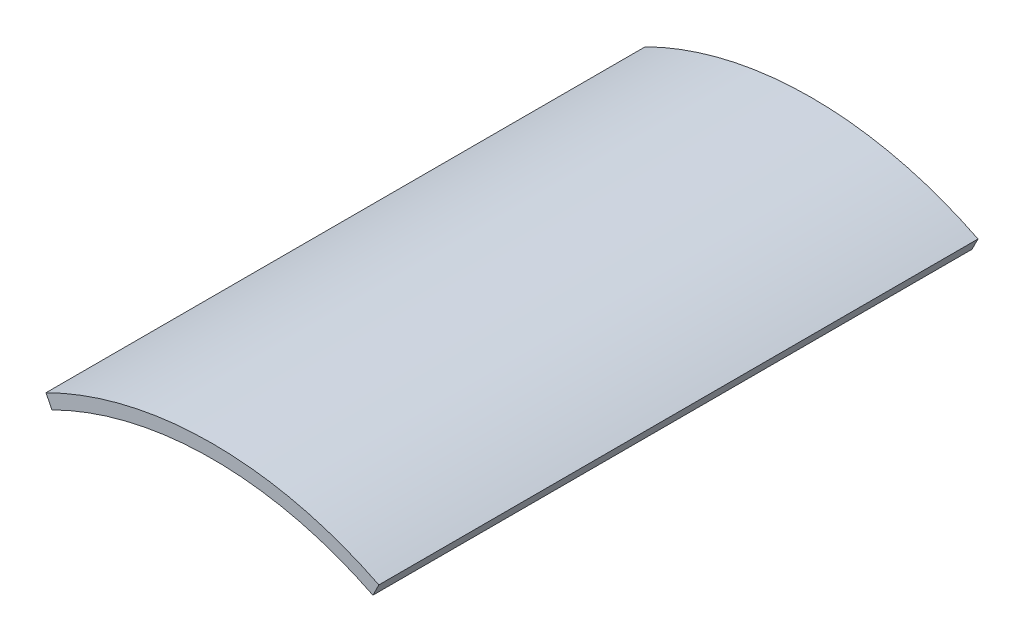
ISO-10303-21;
HEADER;
FILE_DESCRIPTION(('STEP AP214'),'2;1');
FILE_NAME('part.step','',(''),(''),'','','');
FILE_SCHEMA(('AUTOMOTIVE_DESIGN { 1 0 10303 214 1 1 1 1 }'));
ENDSEC;
DATA;
#1=APPLICATION_CONTEXT('core data for automotive mechanical design processes');
#2=APPLICATION_PROTOCOL_DEFINITION('international standard','automotive_design',2000,#1);
#3=PRODUCT_CONTEXT('',#1,'mechanical');
#4=PRODUCT('Part','Part','',(#3));
#5=PRODUCT_RELATED_PRODUCT_CATEGORY('part','',(#4));
#6=PRODUCT_DEFINITION_FORMATION('','',#4);
#7=PRODUCT_DEFINITION_CONTEXT('part definition',#1,'design');
#8=PRODUCT_DEFINITION('design','',#6,#7);
#9=PRODUCT_DEFINITION_SHAPE('','',#8);
#10=(LENGTH_UNIT() NAMED_UNIT(*) SI_UNIT(.MILLI.,.METRE.));
#11=(NAMED_UNIT(*) PLANE_ANGLE_UNIT() SI_UNIT($,.RADIAN.));
#12=(NAMED_UNIT(*) SI_UNIT($,.STERADIAN.) SOLID_ANGLE_UNIT());
#13=UNCERTAINTY_MEASURE_WITH_UNIT(LENGTH_MEASURE(1.E-05),#10,'distance_accuracy_value','');
#14=(GEOMETRIC_REPRESENTATION_CONTEXT(3) GLOBAL_UNCERTAINTY_ASSIGNED_CONTEXT((#13)) GLOBAL_UNIT_ASSIGNED_CONTEXT((#10,
#11,#12)) REPRESENTATION_CONTEXT('',''));
#15=CARTESIAN_POINT('',(0.,0.,0.));
#16=DIRECTION('',(0.,0.,1.));
#17=DIRECTION('',(1.,0.,0.));
#18=AXIS2_PLACEMENT_3D('',#15,#16,#17);
#19=CARTESIAN_POINT('',(0.,-28.575,45.72));
#20=DIRECTION('',(0.,0.,-1.));
#21=DIRECTION('',(-1.,0.,0.));
#22=AXIS2_PLACEMENT_3D('',#19,#20,#21);
#23=CYLINDRICAL_SURFACE('',#22,27.434913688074);
#24=CARTESIAN_POINT('',(0.,-28.575,0.));
#25=DIRECTION('',(0.,0.,1.));
#26=DIRECTION('',(1.,0.,0.));
#27=AXIS2_PLACEMENT_3D('',#24,#25,#26);
#28=CIRCLE('',#27,27.434913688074);
#29=CARTESIAN_POINT('',(-12.2464750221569,-4.02508475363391,0.));
#30=VERTEX_POINT('',#29);
#31=CARTESIAN_POINT('',(12.2464750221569,-4.02508475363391,0.));
#32=VERTEX_POINT('',#31);
#33=EDGE_CURVE('E82',#30,#32,#28,.F.);
#34=ORIENTED_EDGE('',*,*,#33,.T.);
#35=DIRECTION('',(0.,0.,-1.));
#36=VECTOR('',#35,1.);
#37=CARTESIAN_POINT('',(12.2464750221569,-4.02508475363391,45.72));
#38=LINE('',#37,#36);
#39=CARTESIAN_POINT('',(12.2464750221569,-4.02508475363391,45.72));
#40=VERTEX_POINT('',#39);
#41=EDGE_CURVE('E11',#40,#32,#38,.T.);
#42=ORIENTED_EDGE('',*,*,#41,.F.);
#43=CARTESIAN_POINT('',(0.,-28.575,45.72));
#44=DIRECTION('',(0.,0.,1.));
#45=DIRECTION('',(1.,0.,0.));
#46=AXIS2_PLACEMENT_3D('',#43,#44,#45);
#47=CIRCLE('',#46,27.434913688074);
#48=CARTESIAN_POINT('',(-12.2464750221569,-4.02508475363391,45.72));
#49=VERTEX_POINT('',#48);
#50=EDGE_CURVE('E93',#49,#40,#47,.F.);
#51=ORIENTED_EDGE('',*,*,#50,.F.);
#52=DIRECTION('',(0.,0.,-1.));
#53=VECTOR('',#52,1.);
#54=CARTESIAN_POINT('',(-12.2464750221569,-4.02508475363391,45.72));
#55=LINE('',#54,#53);
#56=EDGE_CURVE('E45',#49,#30,#55,.T.);
#57=ORIENTED_EDGE('',*,*,#56,.T.);
#58=EDGE_LOOP('',(#34,#42,#51,#57));
#59=FACE_BOUND('',#58,.T.);
#60=ADVANCED_FACE('F31',(#59),#23,.F.);
#61=CARTESIAN_POINT('',(12.7,-3.11592519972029,45.72));
#62=DIRECTION('',(0.894842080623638,-0.446382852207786,0.));
#63=DIRECTION('',(0.446382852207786,0.894842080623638,0.));
#64=AXIS2_PLACEMENT_3D('',#61,#62,#63);
#65=PLANE('',#64);
#66=DIRECTION('',(-0.446382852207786,-0.894842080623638,0.));
#67=VECTOR('',#66,1.);
#68=CARTESIAN_POINT('',(12.7,-3.11592519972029,0.));
#69=LINE('',#68,#67);
#70=CARTESIAN_POINT('',(12.7,-3.11592519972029,0.));
#71=VERTEX_POINT('',#70);
#72=EDGE_CURVE('E76',#71,#32,#69,.T.);
#73=ORIENTED_EDGE('',*,*,#72,.F.);
#74=DIRECTION('',(0.,0.,-1.));
#75=VECTOR('',#74,1.);
#76=CARTESIAN_POINT('',(12.7,-3.11592519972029,45.72));
#77=LINE('',#76,#75);
#78=CARTESIAN_POINT('',(12.7,-3.11592519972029,45.72));
#79=VERTEX_POINT('',#78);
#80=EDGE_CURVE('E38',#79,#71,#77,.T.);
#81=ORIENTED_EDGE('',*,*,#80,.F.);
#82=DIRECTION('',(-0.446382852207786,-0.894842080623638,0.));
#83=VECTOR('',#82,1.);
#84=CARTESIAN_POINT('',(12.7,-3.11592519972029,45.72));
#85=LINE('',#84,#83);
#86=EDGE_CURVE('E79',#79,#40,#85,.T.);
#87=ORIENTED_EDGE('',*,*,#86,.T.);
#88=ORIENTED_EDGE('',*,*,#41,.T.);
#89=EDGE_LOOP('',(#73,#81,#87,#88));
#90=FACE_BOUND('',#89,.T.);
#91=ADVANCED_FACE('F74',(#90),#65,.T.);
#92=CARTESIAN_POINT('',(0.,-28.575,45.72));
#93=DIRECTION('',(0.,0.,-1.));
#94=DIRECTION('',(-1.,0.,0.));
#95=AXIS2_PLACEMENT_3D('',#92,#93,#94);
#96=CYLINDRICAL_SURFACE('',#95,28.450913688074);
#97=CARTESIAN_POINT('',(0.,-28.575,0.));
#98=DIRECTION('',(0.,0.,-1.));
#99=DIRECTION('',(-1.,0.,0.));
#100=AXIS2_PLACEMENT_3D('',#97,#98,#99);
#101=CIRCLE('',#100,28.450913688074);
#102=CARTESIAN_POINT('',(-12.7,-3.11592519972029,0.));
#103=VERTEX_POINT('',#102);
#104=EDGE_CURVE('E87',#103,#71,#101,.T.);
#105=ORIENTED_EDGE('',*,*,#104,.F.);
#106=DIRECTION('',(0.,0.,-1.));
#107=VECTOR('',#106,1.);
#108=CARTESIAN_POINT('',(-12.7,-3.11592519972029,45.72));
#109=LINE('',#108,#107);
#110=CARTESIAN_POINT('',(-12.7,-3.11592519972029,45.72));
#111=VERTEX_POINT('',#110);
#112=EDGE_CURVE('E53',#111,#103,#109,.T.);
#113=ORIENTED_EDGE('',*,*,#112,.F.);
#114=CARTESIAN_POINT('',(0.,-28.575,45.72));
#115=DIRECTION('',(0.,0.,-1.));
#116=DIRECTION('',(-1.,0.,0.));
#117=AXIS2_PLACEMENT_3D('',#114,#115,#116);
#118=CIRCLE('',#117,28.450913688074);
#119=EDGE_CURVE('E96',#111,#79,#118,.T.);
#120=ORIENTED_EDGE('',*,*,#119,.T.);
#121=ORIENTED_EDGE('',*,*,#80,.T.);
#122=EDGE_LOOP('',(#105,#113,#120,#121));
#123=FACE_BOUND('',#122,.T.);
#124=ADVANCED_FACE('F101',(#123),#96,.T.);
#125=CARTESIAN_POINT('',(-12.2464750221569,-4.02508475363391,45.72));
#126=DIRECTION('',(-0.894842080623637,-0.446382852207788,0.));
#127=DIRECTION('',(0.446382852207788,-0.894842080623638,0.));
#128=AXIS2_PLACEMENT_3D('',#125,#126,#127);
#129=PLANE('',#128);
#130=DIRECTION('',(-0.446382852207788,0.894842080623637,0.));
#131=VECTOR('',#130,1.);
#132=CARTESIAN_POINT('',(-12.2464750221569,-4.02508475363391,0.));
#133=LINE('',#132,#131);
#134=EDGE_CURVE('E89',#30,#103,#133,.T.);
#135=ORIENTED_EDGE('',*,*,#134,.F.);
#136=ORIENTED_EDGE('',*,*,#56,.F.);
#137=DIRECTION('',(-0.446382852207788,0.894842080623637,0.));
#138=VECTOR('',#137,1.);
#139=CARTESIAN_POINT('',(-12.2464750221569,-4.02508475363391,45.72));
#140=LINE('',#139,#138);
#141=EDGE_CURVE('E98',#49,#111,#140,.T.);
#142=ORIENTED_EDGE('',*,*,#141,.T.);
#143=ORIENTED_EDGE('',*,*,#112,.T.);
#144=EDGE_LOOP('',(#135,#136,#142,#143));
#145=FACE_BOUND('',#144,.T.);
#146=ADVANCED_FACE('F105',(#145),#129,.T.);
#147=CARTESIAN_POINT('',(0.,-28.575,45.72));
#148=DIRECTION('',(0.,0.,1.));
#149=DIRECTION('',(1.,0.,0.));
#150=AXIS2_PLACEMENT_3D('',#147,#148,#149);
#151=PLANE('',#150);
#152=ORIENTED_EDGE('',*,*,#50,.T.);
#153=ORIENTED_EDGE('',*,*,#86,.F.);
#154=ORIENTED_EDGE('',*,*,#119,.F.);
#155=ORIENTED_EDGE('',*,*,#141,.F.);
#156=EDGE_LOOP('',(#152,#153,#154,#155));
#157=FACE_BOUND('',#156,.T.);
#158=ADVANCED_FACE('F103',(#157),#151,.T.);
#159=CARTESIAN_POINT('',(0.,-28.575,0.));
#160=DIRECTION('',(0.,0.,1.));
#161=DIRECTION('',(1.,0.,0.));
#162=AXIS2_PLACEMENT_3D('',#159,#160,#161);
#163=PLANE('',#162);
#164=ORIENTED_EDGE('',*,*,#33,.F.);
#165=ORIENTED_EDGE('',*,*,#134,.T.);
#166=ORIENTED_EDGE('',*,*,#104,.T.);
#167=ORIENTED_EDGE('',*,*,#72,.T.);
#168=EDGE_LOOP('',(#164,#165,#166,#167));
#169=FACE_BOUND('',#168,.T.);
#170=ADVANCED_FACE('F86',(#169),#163,.F.);
#171=CLOSED_SHELL('',(#60,#91,#124,#146,#158,#170));
#172=MANIFOLD_SOLID_BREP('B2',#171);
#173=ADVANCED_BREP_SHAPE_REPRESENTATION('',(#18,#172),#14);
#174=SHAPE_DEFINITION_REPRESENTATION(#9,#173);
ENDSEC;
END-ISO-10303-21;
